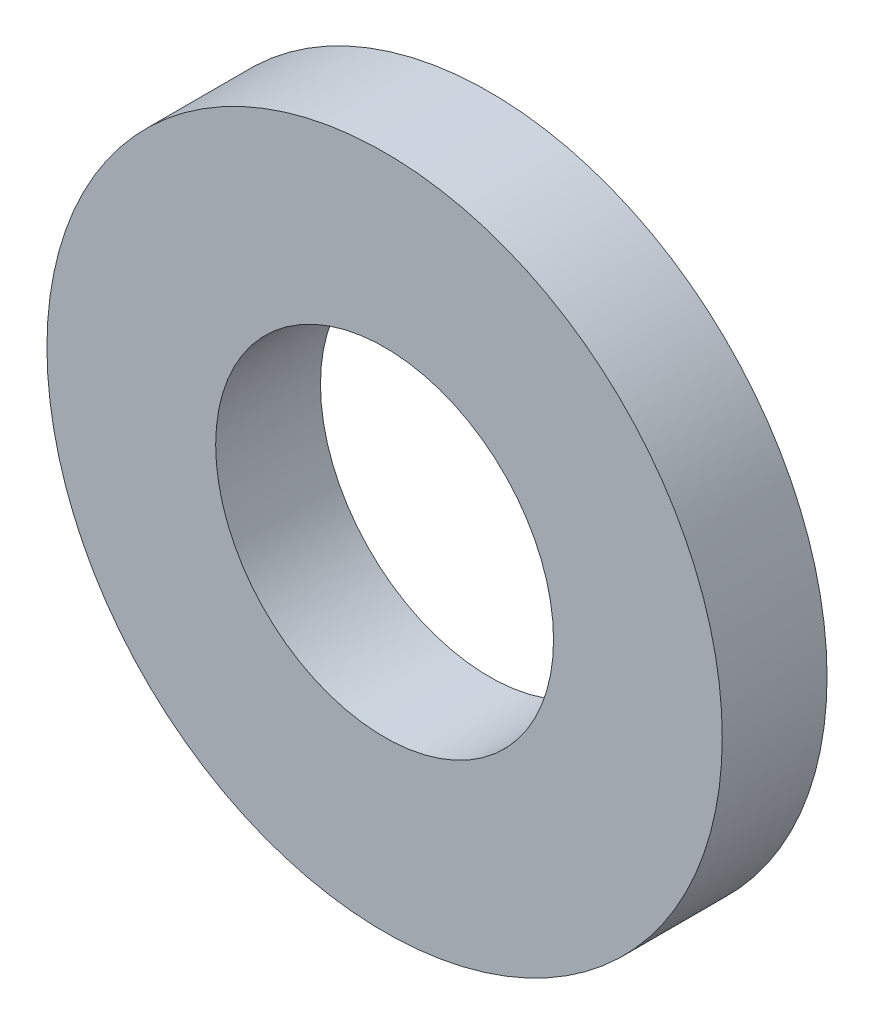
from build123d import *

# Parameters (mm, degrees)
LOGO3_BIB1_W = 5.153025
LOGO3_BIB1_H = 3.2004


with BuildPart() as part:
    # Logo3_bib1 → Revolve1 (revolve)
    with BuildSketch(Plane(origin=(0, 0, 0), x_dir=(-1, 0, 0), z_dir=(0, -1, 0))):
        with Locations((7.7358875, 1.6002)):
            Rectangle(LOGO3_BIB1_W, LOGO3_BIB1_H)
    revolve(axis=Axis((0, 0, -22.542791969), (0, 0, 1)))


solid = part.part
